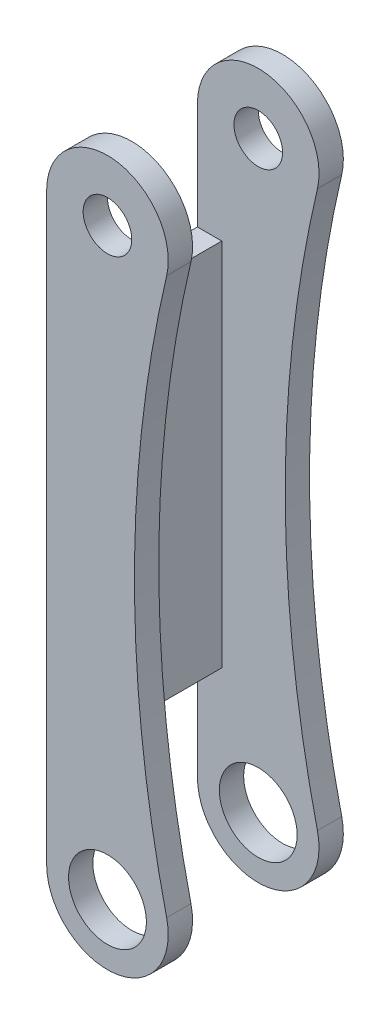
ISO-10303-21;
HEADER;
FILE_DESCRIPTION(('STEP AP214'),'2;1');
FILE_NAME('part.step','',(''),(''),'','','');
FILE_SCHEMA(('AUTOMOTIVE_DESIGN { 1 0 10303 214 1 1 1 1 }'));
ENDSEC;
DATA;
#1=APPLICATION_CONTEXT('core data for automotive mechanical design processes');
#2=APPLICATION_PROTOCOL_DEFINITION('international standard','automotive_design',2000,#1);
#3=PRODUCT_CONTEXT('',#1,'mechanical');
#4=PRODUCT('Part','Part','',(#3));
#5=PRODUCT_RELATED_PRODUCT_CATEGORY('part','',(#4));
#6=PRODUCT_DEFINITION_FORMATION('','',#4);
#7=PRODUCT_DEFINITION_CONTEXT('part definition',#1,'design');
#8=PRODUCT_DEFINITION('design','',#6,#7);
#9=PRODUCT_DEFINITION_SHAPE('','',#8);
#10=(LENGTH_UNIT() NAMED_UNIT(*) SI_UNIT(.MILLI.,.METRE.));
#11=(NAMED_UNIT(*) PLANE_ANGLE_UNIT() SI_UNIT($,.RADIAN.));
#12=(NAMED_UNIT(*) SI_UNIT($,.STERADIAN.) SOLID_ANGLE_UNIT());
#13=UNCERTAINTY_MEASURE_WITH_UNIT(LENGTH_MEASURE(1.E-05),#10,'distance_accuracy_value','');
#14=(GEOMETRIC_REPRESENTATION_CONTEXT(3) GLOBAL_UNCERTAINTY_ASSIGNED_CONTEXT((#13)) GLOBAL_UNIT_ASSIGNED_CONTEXT((#10,
#11,#12)) REPRESENTATION_CONTEXT('',''));
#15=CARTESIAN_POINT('',(0.,0.,0.));
#16=DIRECTION('',(0.,0.,1.));
#17=DIRECTION('',(1.,0.,0.));
#18=AXIS2_PLACEMENT_3D('',#15,#16,#17);
#19=CARTESIAN_POINT('',(0.,0.,36.));
#20=DIRECTION('',(0.,0.,-1.));
#21=DIRECTION('',(-1.,0.,0.));
#22=AXIS2_PLACEMENT_3D('',#19,#20,#21);
#23=CYLINDRICAL_SURFACE('',#22,8.);
#24=CARTESIAN_POINT('',(0.,0.,0.));
#25=DIRECTION('',(0.,0.,1.));
#26=DIRECTION('',(-1.,0.,0.));
#27=AXIS2_PLACEMENT_3D('',#24,#25,#26);
#28=CIRCLE('',#27,8.);
#29=CARTESIAN_POINT('',(-8.,0.,0.));
#30=VERTEX_POINT('',#29);
#31=EDGE_CURVE('E225',#30,#30,#28,.T.);
#32=ORIENTED_EDGE('',*,*,#31,.F.);
#33=EDGE_LOOP('',(#32));
#34=FACE_BOUND('',#33,.T.);
#35=CARTESIAN_POINT('',(0.,0.,5.));
#36=DIRECTION('',(0.,0.,1.));
#37=DIRECTION('',(1.,0.,0.));
#38=AXIS2_PLACEMENT_3D('',#35,#36,#37);
#39=CIRCLE('',#38,8.);
#40=CARTESIAN_POINT('',(8.,0.,5.));
#41=VERTEX_POINT('',#40);
#42=EDGE_CURVE('E212',#41,#41,#39,.T.);
#43=ORIENTED_EDGE('',*,*,#42,.T.);
#44=EDGE_LOOP('',(#43));
#45=FACE_BOUND('',#44,.T.);
#46=ADVANCED_FACE('F37',(#34,#45),#23,.F.);
#47=CARTESIAN_POINT('',(0.,0.,36.));
#48=DIRECTION('',(0.,0.,-1.));
#49=DIRECTION('',(-1.,0.,0.));
#50=AXIS2_PLACEMENT_3D('',#47,#48,#49);
#51=CYLINDRICAL_SURFACE('',#50,12.5);
#52=CARTESIAN_POINT('',(0.,0.,5.));
#53=DIRECTION('',(0.,0.,1.));
#54=DIRECTION('',(1.,0.,0.));
#55=AXIS2_PLACEMENT_3D('',#52,#53,#54);
#56=CIRCLE('',#55,12.5);
#57=CARTESIAN_POINT('',(-12.5,0.,5.));
#58=VERTEX_POINT('',#57);
#59=CARTESIAN_POINT('',(12.1690893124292,2.85714285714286,5.));
#60=VERTEX_POINT('',#59);
#61=EDGE_CURVE('E61',#58,#60,#56,.T.);
#62=ORIENTED_EDGE('',*,*,#61,.F.);
#63=DIRECTION('',(0.,0.,-1.));
#64=VECTOR('',#63,1.);
#65=CARTESIAN_POINT('',(-12.5,0.,36.));
#66=LINE('',#65,#64);
#67=CARTESIAN_POINT('',(-12.5,0.,0.));
#68=VERTEX_POINT('',#67);
#69=EDGE_CURVE('E242',#58,#68,#66,.T.);
#70=ORIENTED_EDGE('',*,*,#69,.T.);
#71=CARTESIAN_POINT('',(0.,0.,0.));
#72=DIRECTION('',(0.,0.,1.));
#73=DIRECTION('',(-1.,0.,0.));
#74=AXIS2_PLACEMENT_3D('',#71,#72,#73);
#75=CIRCLE('',#74,12.5);
#76=CARTESIAN_POINT('',(12.1690893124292,2.85714285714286,0.));
#77=VERTEX_POINT('',#76);
#78=EDGE_CURVE('E237',#68,#77,#75,.T.);
#79=ORIENTED_EDGE('',*,*,#78,.T.);
#80=DIRECTION('',(0.,0.,-1.));
#81=VECTOR('',#80,1.);
#82=CARTESIAN_POINT('',(12.1690893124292,2.85714285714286,36.));
#83=LINE('',#82,#81);
#84=EDGE_CURVE('E240',#60,#77,#83,.T.);
#85=ORIENTED_EDGE('',*,*,#84,.F.);
#86=EDGE_LOOP('',(#62,#70,#79,#85));
#87=FACE_BOUND('',#86,.T.);
#88=ADVANCED_FACE('F259',(#87),#51,.T.);
#89=CARTESIAN_POINT('',(-12.5,120.,36.));
#90=DIRECTION('',(1.,0.,0.));
#91=DIRECTION('',(0.,1.,0.));
#92=AXIS2_PLACEMENT_3D('',#89,#90,#91);
#93=PLANE('',#92);
#94=DIRECTION('',(0.,1.,0.));
#95=VECTOR('',#94,1.);
#96=CARTESIAN_POINT('',(-12.5,164.395516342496,5.));
#97=LINE('',#96,#95);
#98=CARTESIAN_POINT('',(-12.5,21.9999999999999,5.));
#99=VERTEX_POINT('',#98);
#100=EDGE_CURVE('E209',#58,#99,#97,.T.);
#101=ORIENTED_EDGE('',*,*,#100,.T.);
#102=DIRECTION('',(0.,0.,1.));
#103=VECTOR('',#102,1.);
#104=CARTESIAN_POINT('',(-12.5,21.9999999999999,5.00000000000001));
#105=LINE('',#104,#103);
#106=CARTESIAN_POINT('',(-12.5,21.9999999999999,31.));
#107=VERTEX_POINT('',#106);
#108=EDGE_CURVE('E53',#99,#107,#105,.T.);
#109=ORIENTED_EDGE('',*,*,#108,.T.);
#110=DIRECTION('',(0.,-1.,0.));
#111=VECTOR('',#110,1.);
#112=CARTESIAN_POINT('',(-12.5,164.395516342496,31.));
#113=LINE('',#112,#111);
#114=CARTESIAN_POINT('',(-12.5,0.,31.));
#115=VERTEX_POINT('',#114);
#116=EDGE_CURVE('E178',#107,#115,#113,.T.);
#117=ORIENTED_EDGE('',*,*,#116,.T.);
#118=DIRECTION('',(0.,0.,-1.));
#119=VECTOR('',#118,1.);
#120=CARTESIAN_POINT('',(-12.5,0.,36.));
#121=LINE('',#120,#119);
#122=CARTESIAN_POINT('',(-12.5,0.,36.));
#123=VERTEX_POINT('',#122);
#124=EDGE_CURVE('E165',#123,#115,#121,.T.);
#125=ORIENTED_EDGE('',*,*,#124,.F.);
#126=DIRECTION('',(0.,-1.,0.));
#127=VECTOR('',#126,1.);
#128=CARTESIAN_POINT('',(-12.5,120.,36.));
#129=LINE('',#128,#127);
#130=CARTESIAN_POINT('',(-12.5,120.,36.));
#131=VERTEX_POINT('',#130);
#132=EDGE_CURVE('E134',#131,#123,#129,.T.);
#133=ORIENTED_EDGE('',*,*,#132,.F.);
#134=DIRECTION('',(0.,0.,-1.));
#135=VECTOR('',#134,1.);
#136=CARTESIAN_POINT('',(-12.5,120.,36.));
#137=LINE('',#136,#135);
#138=CARTESIAN_POINT('',(-12.5,120.,31.));
#139=VERTEX_POINT('',#138);
#140=EDGE_CURVE('E177',#131,#139,#137,.T.);
#141=ORIENTED_EDGE('',*,*,#140,.T.);
#142=CARTESIAN_POINT('',(-12.5,97.9999999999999,31.));
#143=VERTEX_POINT('',#142);
#144=EDGE_CURVE('E174',#139,#143,#113,.T.);
#145=ORIENTED_EDGE('',*,*,#144,.T.);
#146=DIRECTION('',(0.,0.,-1.));
#147=VECTOR('',#146,1.);
#148=CARTESIAN_POINT('',(-12.5,97.9999999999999,5.));
#149=LINE('',#148,#147);
#150=CARTESIAN_POINT('',(-12.5,97.9999999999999,5.));
#151=VERTEX_POINT('',#150);
#152=EDGE_CURVE('E187',#143,#151,#149,.T.);
#153=ORIENTED_EDGE('',*,*,#152,.T.);
#154=CARTESIAN_POINT('',(-12.5,120.,5.));
#155=VERTEX_POINT('',#154);
#156=EDGE_CURVE('E202',#151,#155,#97,.T.);
#157=ORIENTED_EDGE('',*,*,#156,.T.);
#158=DIRECTION('',(0.,0.,-1.));
#159=VECTOR('',#158,1.);
#160=CARTESIAN_POINT('',(-12.5,120.,36.));
#161=LINE('',#160,#159);
#162=CARTESIAN_POINT('',(-12.5,120.,0.));
#163=VERTEX_POINT('',#162);
#164=EDGE_CURVE('E46',#155,#163,#161,.T.);
#165=ORIENTED_EDGE('',*,*,#164,.T.);
#166=DIRECTION('',(0.,-1.,0.));
#167=VECTOR('',#166,1.);
#168=CARTESIAN_POINT('',(-12.5,120.,0.));
#169=LINE('',#168,#167);
#170=EDGE_CURVE('E234',#163,#68,#169,.T.);
#171=ORIENTED_EDGE('',*,*,#170,.T.);
#172=ORIENTED_EDGE('',*,*,#69,.F.);
#173=EDGE_LOOP('',(#101,#109,#117,#125,#133,#141,#145,#153,#157,#165,#171,#172));
#174=FACE_BOUND('',#173,.T.);
#175=ADVANCED_FACE('F246',(#174),#93,.F.);
#176=CARTESIAN_POINT('',(0.,120.,36.));
#177=DIRECTION('',(0.,0.,-1.));
#178=DIRECTION('',(-1.,0.,0.));
#179=AXIS2_PLACEMENT_3D('',#176,#177,#178);
#180=CYLINDRICAL_SURFACE('',#179,12.5);
#181=CARTESIAN_POINT('',(0.,120.,5.));
#182=DIRECTION('',(0.,0.,1.));
#183=DIRECTION('',(1.,0.,0.));
#184=AXIS2_PLACEMENT_3D('',#181,#182,#183);
#185=CIRCLE('',#184,12.5);
#186=CARTESIAN_POINT('',(12.1690893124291,117.142857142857,5.));
#187=VERTEX_POINT('',#186);
#188=EDGE_CURVE('E219',#187,#155,#185,.T.);
#189=ORIENTED_EDGE('',*,*,#188,.F.);
#190=DIRECTION('',(0.,0.,-1.));
#191=VECTOR('',#190,1.);
#192=CARTESIAN_POINT('',(12.1690893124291,117.142857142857,36.));
#193=LINE('',#192,#191);
#194=CARTESIAN_POINT('',(12.1690893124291,117.142857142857,0.));
#195=VERTEX_POINT('',#194);
#196=EDGE_CURVE('E11',#187,#195,#193,.T.);
#197=ORIENTED_EDGE('',*,*,#196,.T.);
#198=CARTESIAN_POINT('',(0.,120.,0.));
#199=DIRECTION('',(0.,0.,1.));
#200=DIRECTION('',(-1.,0.,0.));
#201=AXIS2_PLACEMENT_3D('',#198,#199,#200);
#202=CIRCLE('',#201,12.5);
#203=EDGE_CURVE('E231',#195,#163,#202,.T.);
#204=ORIENTED_EDGE('',*,*,#203,.T.);
#205=ORIENTED_EDGE('',*,*,#164,.F.);
#206=EDGE_LOOP('',(#189,#197,#204,#205));
#207=FACE_BOUND('',#206,.T.);
#208=ADVANCED_FACE('F253',(#207),#180,.T.);
#209=CARTESIAN_POINT('',(255.550875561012,60.,36.));
#210=DIRECTION('',(0.,0.,-1.));
#211=DIRECTION('',(-1.,0.,0.));
#212=AXIS2_PLACEMENT_3D('',#209,#210,#211);
#213=CYLINDRICAL_SURFACE('',#212,250.);
#214=CARTESIAN_POINT('',(255.550875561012,60.,5.));
#215=DIRECTION('',(0.,0.,1.));
#216=DIRECTION('',(1.,0.,0.));
#217=AXIS2_PLACEMENT_3D('',#214,#215,#216);
#218=CIRCLE('',#217,250.);
#219=EDGE_CURVE('E216',#60,#187,#218,.F.);
#220=ORIENTED_EDGE('',*,*,#219,.F.);
#221=ORIENTED_EDGE('',*,*,#84,.T.);
#222=CARTESIAN_POINT('',(255.550875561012,60.,0.));
#223=DIRECTION('',(0.,0.,-1.));
#224=DIRECTION('',(1.,0.,0.));
#225=AXIS2_PLACEMENT_3D('',#222,#223,#224);
#226=CIRCLE('',#225,250.);
#227=EDGE_CURVE('E228',#77,#195,#226,.T.);
#228=ORIENTED_EDGE('',*,*,#227,.T.);
#229=ORIENTED_EDGE('',*,*,#196,.F.);
#230=EDGE_LOOP('',(#220,#221,#228,#229));
#231=FACE_BOUND('',#230,.T.);
#232=ADVANCED_FACE('F39',(#231),#213,.F.);
#233=CARTESIAN_POINT('',(255.550875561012,60.,0.));
#234=DIRECTION('',(0.,0.,1.));
#235=DIRECTION('',(1.,0.,0.));
#236=AXIS2_PLACEMENT_3D('',#233,#234,#235);
#237=PLANE('',#236);
#238=ORIENTED_EDGE('',*,*,#227,.F.);
#239=ORIENTED_EDGE('',*,*,#78,.F.);
#240=ORIENTED_EDGE('',*,*,#170,.F.);
#241=ORIENTED_EDGE('',*,*,#203,.F.);
#242=EDGE_LOOP('',(#238,#239,#240,#241));
#243=FACE_BOUND('',#242,.T.);
#244=ORIENTED_EDGE('',*,*,#31,.T.);
#245=EDGE_LOOP('',(#244));
#246=FACE_BOUND('',#245,.T.);
#247=CARTESIAN_POINT('',(0.,120.,0.));
#248=DIRECTION('',(0.,0.,1.));
#249=DIRECTION('',(-1.,0.,0.));
#250=AXIS2_PLACEMENT_3D('',#247,#248,#249);
#251=CIRCLE('',#250,5.);
#252=CARTESIAN_POINT('',(-5.00000000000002,120.,0.));
#253=VERTEX_POINT('',#252);
#254=EDGE_CURVE('E222',#253,#253,#251,.T.);
#255=ORIENTED_EDGE('',*,*,#254,.T.);
#256=EDGE_LOOP('',(#255));
#257=FACE_BOUND('',#256,.T.);
#258=ADVANCED_FACE('F257',(#243,#246,#257),#237,.F.);
#259=CARTESIAN_POINT('',(0.,120.,36.));
#260=DIRECTION('',(0.,0.,-1.));
#261=DIRECTION('',(-1.,0.,0.));
#262=AXIS2_PLACEMENT_3D('',#259,#260,#261);
#263=CYLINDRICAL_SURFACE('',#262,5.);
#264=ORIENTED_EDGE('',*,*,#254,.F.);
#265=EDGE_LOOP('',(#264));
#266=FACE_BOUND('',#265,.T.);
#267=CARTESIAN_POINT('',(0.,120.,5.));
#268=DIRECTION('',(0.,0.,1.));
#269=DIRECTION('',(1.,0.,0.));
#270=AXIS2_PLACEMENT_3D('',#267,#268,#269);
#271=CIRCLE('',#270,5.);
#272=CARTESIAN_POINT('',(4.99999999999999,120.,5.));
#273=VERTEX_POINT('',#272);
#274=EDGE_CURVE('E41',#273,#273,#271,.T.);
#275=ORIENTED_EDGE('',*,*,#274,.T.);
#276=EDGE_LOOP('',(#275));
#277=FACE_BOUND('',#276,.T.);
#278=ADVANCED_FACE('F299',(#266,#277),#263,.F.);
#279=CARTESIAN_POINT('',(12.5,164.395516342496,5.));
#280=DIRECTION('',(0.,0.,1.));
#281=DIRECTION('',(1.,0.,0.));
#282=AXIS2_PLACEMENT_3D('',#279,#280,#281);
#283=PLANE('',#282);
#284=DIRECTION('',(-1.,0.,0.));
#285=VECTOR('',#284,1.);
#286=CARTESIAN_POINT('',(-7.50000000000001,97.9999999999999,5.));
#287=LINE('',#286,#285);
#288=CARTESIAN_POINT('',(-7.50000000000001,97.9999999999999,5.));
#289=VERTEX_POINT('',#288);
#290=EDGE_CURVE('E200',#289,#151,#287,.T.);
#291=ORIENTED_EDGE('',*,*,#290,.F.);
#292=DIRECTION('',(0.,-1.,0.));
#293=VECTOR('',#292,1.);
#294=CARTESIAN_POINT('',(-7.50000000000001,97.9999999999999,5.));
#295=LINE('',#294,#293);
#296=CARTESIAN_POINT('',(-7.5,21.9999999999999,5.00000000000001));
#297=VERTEX_POINT('',#296);
#298=EDGE_CURVE('E183',#289,#297,#295,.T.);
#299=ORIENTED_EDGE('',*,*,#298,.T.);
#300=DIRECTION('',(-1.,0.,0.));
#301=VECTOR('',#300,1.);
#302=CARTESIAN_POINT('',(-7.5,21.9999999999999,5.00000000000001));
#303=LINE('',#302,#301);
#304=EDGE_CURVE('E196',#297,#99,#303,.T.);
#305=ORIENTED_EDGE('',*,*,#304,.T.);
#306=ORIENTED_EDGE('',*,*,#100,.F.);
#307=ORIENTED_EDGE('',*,*,#61,.T.);
#308=ORIENTED_EDGE('',*,*,#219,.T.);
#309=ORIENTED_EDGE('',*,*,#188,.T.);
#310=ORIENTED_EDGE('',*,*,#156,.F.);
#311=EDGE_LOOP('',(#291,#299,#305,#306,#307,#308,#309,#310));
#312=FACE_BOUND('',#311,.T.);
#313=ORIENTED_EDGE('',*,*,#274,.F.);
#314=EDGE_LOOP('',(#313));
#315=FACE_BOUND('',#314,.T.);
#316=ORIENTED_EDGE('',*,*,#42,.F.);
#317=EDGE_LOOP('',(#316));
#318=FACE_BOUND('',#317,.T.);
#319=ADVANCED_FACE('F263',(#312,#315,#318),#283,.T.);
#320=CARTESIAN_POINT('',(-7.50000000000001,97.9999999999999,5.));
#321=DIRECTION('',(0.,1.,0.));
#322=DIRECTION('',(-1.,0.,0.));
#323=AXIS2_PLACEMENT_3D('',#320,#321,#322);
#324=PLANE('',#323);
#325=ORIENTED_EDGE('',*,*,#152,.F.);
#326=DIRECTION('',(-1.,0.,0.));
#327=VECTOR('',#326,1.);
#328=CARTESIAN_POINT('',(-7.50000000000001,97.9999999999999,31.));
#329=LINE('',#328,#327);
#330=CARTESIAN_POINT('',(-7.50000000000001,97.9999999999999,31.));
#331=VERTEX_POINT('',#330);
#332=EDGE_CURVE('E203',#331,#143,#329,.T.);
#333=ORIENTED_EDGE('',*,*,#332,.F.);
#334=DIRECTION('',(0.,0.,-1.));
#335=VECTOR('',#334,1.);
#336=CARTESIAN_POINT('',(-7.50000000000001,97.9999999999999,5.));
#337=LINE('',#336,#335);
#338=EDGE_CURVE('E193',#331,#289,#337,.T.);
#339=ORIENTED_EDGE('',*,*,#338,.T.);
#340=ORIENTED_EDGE('',*,*,#290,.T.);
#341=EDGE_LOOP('',(#325,#333,#339,#340));
#342=FACE_BOUND('',#341,.T.);
#343=ADVANCED_FACE('F312',(#342),#324,.T.);
#344=CARTESIAN_POINT('',(-7.5,21.9999999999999,5.00000000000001));
#345=DIRECTION('',(0.,-1.,0.));
#346=DIRECTION('',(1.,0.,0.));
#347=AXIS2_PLACEMENT_3D('',#344,#345,#346);
#348=PLANE('',#347);
#349=ORIENTED_EDGE('',*,*,#108,.F.);
#350=ORIENTED_EDGE('',*,*,#304,.F.);
#351=DIRECTION('',(0.,0.,1.));
#352=VECTOR('',#351,1.);
#353=CARTESIAN_POINT('',(-7.5,21.9999999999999,5.00000000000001));
#354=LINE('',#353,#352);
#355=CARTESIAN_POINT('',(-7.5,21.9999999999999,31.));
#356=VERTEX_POINT('',#355);
#357=EDGE_CURVE('E186',#297,#356,#354,.T.);
#358=ORIENTED_EDGE('',*,*,#357,.T.);
#359=DIRECTION('',(-1.,0.,0.));
#360=VECTOR('',#359,1.);
#361=CARTESIAN_POINT('',(-7.5,21.9999999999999,31.));
#362=LINE('',#361,#360);
#363=EDGE_CURVE('E206',#356,#107,#362,.T.);
#364=ORIENTED_EDGE('',*,*,#363,.T.);
#365=EDGE_LOOP('',(#349,#350,#358,#364));
#366=FACE_BOUND('',#365,.T.);
#367=ADVANCED_FACE('F267',(#366),#348,.T.);
#368=CARTESIAN_POINT('',(-7.5,0.,0.));
#369=DIRECTION('',(-1.,0.,0.));
#370=DIRECTION('',(0.,-1.,0.));
#371=AXIS2_PLACEMENT_3D('',#368,#369,#370);
#372=PLANE('',#371);
#373=ORIENTED_EDGE('',*,*,#298,.F.);
#374=ORIENTED_EDGE('',*,*,#338,.F.);
#375=DIRECTION('',(0.,1.,0.));
#376=VECTOR('',#375,1.);
#377=CARTESIAN_POINT('',(-7.50000000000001,97.9999999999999,31.));
#378=LINE('',#377,#376);
#379=EDGE_CURVE('E190',#356,#331,#378,.T.);
#380=ORIENTED_EDGE('',*,*,#379,.F.);
#381=ORIENTED_EDGE('',*,*,#357,.F.);
#382=EDGE_LOOP('',(#373,#374,#380,#381));
#383=FACE_BOUND('',#382,.T.);
#384=ADVANCED_FACE('F270',(#383),#372,.F.);
#385=CARTESIAN_POINT('',(12.5,164.395516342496,31.));
#386=DIRECTION('',(0.,0.,-1.));
#387=DIRECTION('',(-1.,0.,0.));
#388=AXIS2_PLACEMENT_3D('',#385,#386,#387);
#389=PLANE('',#388);
#390=CARTESIAN_POINT('',(0.,0.,31.));
#391=DIRECTION('',(0.,0.,-1.));
#392=DIRECTION('',(-1.,0.,0.));
#393=AXIS2_PLACEMENT_3D('',#390,#391,#392);
#394=CIRCLE('',#393,8.);
#395=CARTESIAN_POINT('',(-8.,0.,31.));
#396=VERTEX_POINT('',#395);
#397=EDGE_CURVE('E164',#396,#396,#394,.T.);
#398=ORIENTED_EDGE('',*,*,#397,.F.);
#399=EDGE_LOOP('',(#398));
#400=FACE_BOUND('',#399,.T.);
#401=CARTESIAN_POINT('',(0.,120.,31.));
#402=DIRECTION('',(0.,0.,-1.));
#403=DIRECTION('',(-1.,0.,0.));
#404=AXIS2_PLACEMENT_3D('',#401,#402,#403);
#405=CIRCLE('',#404,5.);
#406=CARTESIAN_POINT('',(-5.00000000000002,120.,31.));
#407=VERTEX_POINT('',#406);
#408=EDGE_CURVE('E153',#407,#407,#405,.T.);
#409=ORIENTED_EDGE('',*,*,#408,.F.);
#410=EDGE_LOOP('',(#409));
#411=FACE_BOUND('',#410,.T.);
#412=ORIENTED_EDGE('',*,*,#363,.F.);
#413=ORIENTED_EDGE('',*,*,#379,.T.);
#414=ORIENTED_EDGE('',*,*,#332,.T.);
#415=ORIENTED_EDGE('',*,*,#144,.F.);
#416=CARTESIAN_POINT('',(0.,120.,31.));
#417=DIRECTION('',(0.,0.,-1.));
#418=DIRECTION('',(-1.,0.,0.));
#419=AXIS2_PLACEMENT_3D('',#416,#417,#418);
#420=CIRCLE('',#419,12.5);
#421=CARTESIAN_POINT('',(12.1690893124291,117.142857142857,31.));
#422=VERTEX_POINT('',#421);
#423=EDGE_CURVE('E138',#139,#422,#420,.T.);
#424=ORIENTED_EDGE('',*,*,#423,.T.);
#425=CARTESIAN_POINT('',(255.550875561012,60.,31.));
#426=DIRECTION('',(0.,0.,-1.));
#427=DIRECTION('',(-1.,0.,0.));
#428=AXIS2_PLACEMENT_3D('',#425,#426,#427);
#429=CIRCLE('',#428,250.);
#430=CARTESIAN_POINT('',(12.1690893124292,2.85714285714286,31.));
#431=VERTEX_POINT('',#430);
#432=EDGE_CURVE('E169',#422,#431,#429,.F.);
#433=ORIENTED_EDGE('',*,*,#432,.T.);
#434=CARTESIAN_POINT('',(0.,0.,31.));
#435=DIRECTION('',(0.,0.,-1.));
#436=DIRECTION('',(-1.,0.,0.));
#437=AXIS2_PLACEMENT_3D('',#434,#435,#436);
#438=CIRCLE('',#437,12.5);
#439=EDGE_CURVE('E145',#431,#115,#438,.T.);
#440=ORIENTED_EDGE('',*,*,#439,.T.);
#441=ORIENTED_EDGE('',*,*,#116,.F.);
#442=EDGE_LOOP('',(#412,#413,#414,#415,#424,#433,#440,#441));
#443=FACE_BOUND('',#442,.T.);
#444=ADVANCED_FACE('F273',(#400,#411,#443),#389,.T.);
#445=CARTESIAN_POINT('',(255.550875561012,60.,36.));
#446=DIRECTION('',(0.,0.,-1.));
#447=DIRECTION('',(-1.,0.,0.));
#448=AXIS2_PLACEMENT_3D('',#445,#446,#447);
#449=CYLINDRICAL_SURFACE('',#448,250.);
#450=ORIENTED_EDGE('',*,*,#432,.F.);
#451=DIRECTION('',(0.,0.,-1.));
#452=VECTOR('',#451,1.);
#453=CARTESIAN_POINT('',(12.1690893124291,117.142857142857,36.));
#454=LINE('',#453,#452);
#455=CARTESIAN_POINT('',(12.1690893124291,117.142857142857,36.));
#456=VERTEX_POINT('',#455);
#457=EDGE_CURVE('E148',#456,#422,#454,.T.);
#458=ORIENTED_EDGE('',*,*,#457,.F.);
#459=CARTESIAN_POINT('',(255.550875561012,60.,36.));
#460=DIRECTION('',(0.,0.,-1.));
#461=DIRECTION('',(1.,0.,0.));
#462=AXIS2_PLACEMENT_3D('',#459,#460,#461);
#463=CIRCLE('',#462,250.);
#464=CARTESIAN_POINT('',(12.1690893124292,2.85714285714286,36.));
#465=VERTEX_POINT('',#464);
#466=EDGE_CURVE('E131',#465,#456,#463,.T.);
#467=ORIENTED_EDGE('',*,*,#466,.F.);
#468=DIRECTION('',(0.,0.,-1.));
#469=VECTOR('',#468,1.);
#470=CARTESIAN_POINT('',(12.1690893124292,2.85714285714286,36.));
#471=LINE('',#470,#469);
#472=EDGE_CURVE('E142',#465,#431,#471,.T.);
#473=ORIENTED_EDGE('',*,*,#472,.T.);
#474=EDGE_LOOP('',(#450,#458,#467,#473));
#475=FACE_BOUND('',#474,.T.);
#476=ADVANCED_FACE('F150',(#475),#449,.F.);
#477=CARTESIAN_POINT('',(0.,120.,36.));
#478=DIRECTION('',(0.,0.,-1.));
#479=DIRECTION('',(-1.,0.,0.));
#480=AXIS2_PLACEMENT_3D('',#477,#478,#479);
#481=CYLINDRICAL_SURFACE('',#480,12.5);
#482=ORIENTED_EDGE('',*,*,#423,.F.);
#483=ORIENTED_EDGE('',*,*,#140,.F.);
#484=CARTESIAN_POINT('',(0.,120.,36.));
#485=DIRECTION('',(0.,0.,1.));
#486=DIRECTION('',(-1.,0.,0.));
#487=AXIS2_PLACEMENT_3D('',#484,#485,#486);
#488=CIRCLE('',#487,12.5);
#489=EDGE_CURVE('E152',#456,#131,#488,.T.);
#490=ORIENTED_EDGE('',*,*,#489,.F.);
#491=ORIENTED_EDGE('',*,*,#457,.T.);
#492=EDGE_LOOP('',(#482,#483,#490,#491));
#493=FACE_BOUND('',#492,.T.);
#494=ADVANCED_FACE('F277',(#493),#481,.T.);
#495=CARTESIAN_POINT('',(0.,0.,36.));
#496=DIRECTION('',(0.,0.,-1.));
#497=DIRECTION('',(-1.,0.,0.));
#498=AXIS2_PLACEMENT_3D('',#495,#496,#497);
#499=CYLINDRICAL_SURFACE('',#498,12.5);
#500=ORIENTED_EDGE('',*,*,#439,.F.);
#501=ORIENTED_EDGE('',*,*,#472,.F.);
#502=CARTESIAN_POINT('',(0.,0.,36.));
#503=DIRECTION('',(0.,0.,1.));
#504=DIRECTION('',(-1.,0.,0.));
#505=AXIS2_PLACEMENT_3D('',#502,#503,#504);
#506=CIRCLE('',#505,12.5);
#507=EDGE_CURVE('E126',#123,#465,#506,.T.);
#508=ORIENTED_EDGE('',*,*,#507,.F.);
#509=ORIENTED_EDGE('',*,*,#124,.T.);
#510=EDGE_LOOP('',(#500,#501,#508,#509));
#511=FACE_BOUND('',#510,.T.);
#512=ADVANCED_FACE('F143',(#511),#499,.T.);
#513=CARTESIAN_POINT('',(0.,0.,36.));
#514=DIRECTION('',(0.,0.,-1.));
#515=DIRECTION('',(-1.,0.,0.));
#516=AXIS2_PLACEMENT_3D('',#513,#514,#515);
#517=CYLINDRICAL_SURFACE('',#516,8.);
#518=CARTESIAN_POINT('',(0.,0.,36.));
#519=DIRECTION('',(0.,0.,1.));
#520=DIRECTION('',(-1.,0.,0.));
#521=AXIS2_PLACEMENT_3D('',#518,#519,#520);
#522=CIRCLE('',#521,8.);
#523=CARTESIAN_POINT('',(-8.,0.,36.));
#524=VERTEX_POINT('',#523);
#525=EDGE_CURVE('E161',#524,#524,#522,.T.);
#526=ORIENTED_EDGE('',*,*,#525,.T.);
#527=EDGE_LOOP('',(#526));
#528=FACE_BOUND('',#527,.T.);
#529=ORIENTED_EDGE('',*,*,#397,.T.);
#530=EDGE_LOOP('',(#529));
#531=FACE_BOUND('',#530,.T.);
#532=ADVANCED_FACE('F284',(#528,#531),#517,.F.);
#533=CARTESIAN_POINT('',(0.,120.,36.));
#534=DIRECTION('',(0.,0.,-1.));
#535=DIRECTION('',(-1.,0.,0.));
#536=AXIS2_PLACEMENT_3D('',#533,#534,#535);
#537=CYLINDRICAL_SURFACE('',#536,5.);
#538=CARTESIAN_POINT('',(0.,120.,36.));
#539=DIRECTION('',(0.,0.,1.));
#540=DIRECTION('',(-1.,0.,0.));
#541=AXIS2_PLACEMENT_3D('',#538,#539,#540);
#542=CIRCLE('',#541,5.);
#543=CARTESIAN_POINT('',(-5.00000000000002,120.,36.));
#544=VERTEX_POINT('',#543);
#545=EDGE_CURVE('E157',#544,#544,#542,.T.);
#546=ORIENTED_EDGE('',*,*,#545,.T.);
#547=EDGE_LOOP('',(#546));
#548=FACE_BOUND('',#547,.T.);
#549=ORIENTED_EDGE('',*,*,#408,.T.);
#550=EDGE_LOOP('',(#549));
#551=FACE_BOUND('',#550,.T.);
#552=ADVANCED_FACE('F323',(#548,#551),#537,.F.);
#553=CARTESIAN_POINT('',(255.550875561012,60.,36.));
#554=DIRECTION('',(0.,0.,1.));
#555=DIRECTION('',(1.,0.,0.));
#556=AXIS2_PLACEMENT_3D('',#553,#554,#555);
#557=PLANE('',#556);
#558=ORIENTED_EDGE('',*,*,#525,.F.);
#559=EDGE_LOOP('',(#558));
#560=FACE_BOUND('',#559,.T.);
#561=ORIENTED_EDGE('',*,*,#466,.T.);
#562=ORIENTED_EDGE('',*,*,#489,.T.);
#563=ORIENTED_EDGE('',*,*,#132,.T.);
#564=ORIENTED_EDGE('',*,*,#507,.T.);
#565=EDGE_LOOP('',(#561,#562,#563,#564));
#566=FACE_BOUND('',#565,.T.);
#567=ORIENTED_EDGE('',*,*,#545,.F.);
#568=EDGE_LOOP('',(#567));
#569=FACE_BOUND('',#568,.T.);
#570=ADVANCED_FACE('F128',(#560,#566,#569),#557,.T.);
#571=CLOSED_SHELL('',(#46,#88,#175,#208,#232,#258,#278,#319,#343,#367,#384,#444,#476,#494,#512,
#532,#552,#570));
#572=MANIFOLD_SOLID_BREP('B2',#571);
#573=ADVANCED_BREP_SHAPE_REPRESENTATION('',(#18,#572),#14);
#574=SHAPE_DEFINITION_REPRESENTATION(#9,#573);
ENDSEC;
END-ISO-10303-21;
